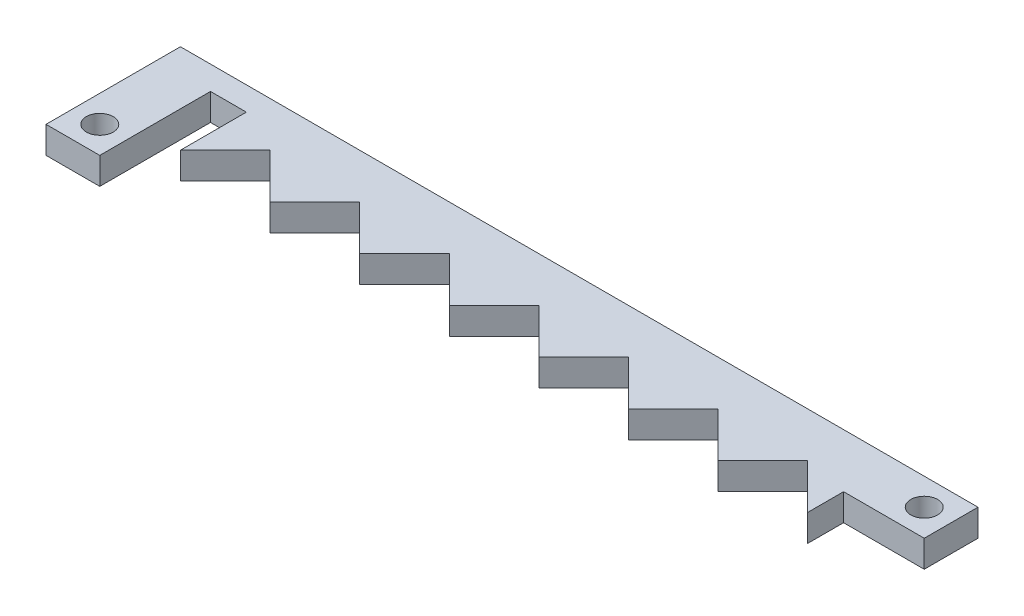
ISO-10303-21;
HEADER;
FILE_DESCRIPTION(('STEP AP214'),'2;1');
FILE_NAME('part.step','',(''),(''),'','','');
FILE_SCHEMA(('AUTOMOTIVE_DESIGN { 1 0 10303 214 1 1 1 1 }'));
ENDSEC;
DATA;
#1=APPLICATION_CONTEXT('core data for automotive mechanical design processes');
#2=APPLICATION_PROTOCOL_DEFINITION('international standard','automotive_design',2000,#1);
#3=PRODUCT_CONTEXT('',#1,'mechanical');
#4=PRODUCT('Part','Part','',(#3));
#5=PRODUCT_RELATED_PRODUCT_CATEGORY('part','',(#4));
#6=PRODUCT_DEFINITION_FORMATION('','',#4);
#7=PRODUCT_DEFINITION_CONTEXT('part definition',#1,'design');
#8=PRODUCT_DEFINITION('design','',#6,#7);
#9=PRODUCT_DEFINITION_SHAPE('','',#8);
#10=(LENGTH_UNIT() NAMED_UNIT(*) SI_UNIT(.MILLI.,.METRE.));
#11=(NAMED_UNIT(*) PLANE_ANGLE_UNIT() SI_UNIT($,.RADIAN.));
#12=(NAMED_UNIT(*) SI_UNIT($,.STERADIAN.) SOLID_ANGLE_UNIT());
#13=UNCERTAINTY_MEASURE_WITH_UNIT(LENGTH_MEASURE(1.E-05),#10,'distance_accuracy_value','');
#14=(GEOMETRIC_REPRESENTATION_CONTEXT(3) GLOBAL_UNCERTAINTY_ASSIGNED_CONTEXT((#13)) GLOBAL_UNIT_ASSIGNED_CONTEXT((#10,
#11,#12)) REPRESENTATION_CONTEXT('',''));
#15=CARTESIAN_POINT('',(0.,0.,0.));
#16=DIRECTION('',(0.,0.,1.));
#17=DIRECTION('',(1.,0.,0.));
#18=AXIS2_PLACEMENT_3D('',#15,#16,#17);
#19=CARTESIAN_POINT('',(0.,3.,0.));
#20=DIRECTION('',(0.,1.,0.));
#21=DIRECTION('',(0.,0.,1.));
#22=AXIS2_PLACEMENT_3D('',#19,#20,#21);
#23=PLANE('',#22);
#24=CARTESIAN_POINT('',(-7.00000000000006,3.,-36.3411545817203));
#25=DIRECTION('',(0.,1.,0.));
#26=DIRECTION('',(0.,0.,1.));
#27=AXIS2_PLACEMENT_3D('',#24,#25,#26);
#28=CIRCLE('',#27,1.5);
#29=CARTESIAN_POINT('',(-7.00000000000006,3.,-34.8411545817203));
#30=VERTEX_POINT('',#29);
#31=EDGE_CURVE('E224',#30,#30,#28,.T.);
#32=ORIENTED_EDGE('',*,*,#31,.F.);
#33=EDGE_LOOP('',(#32));
#34=FACE_BOUND('',#33,.T.);
#35=DIRECTION('',(-1.,0.,0.));
#36=VECTOR('',#35,1.);
#37=CARTESIAN_POINT('',(5.,3.,-48.3411545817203));
#38=LINE('',#37,#36);
#39=CARTESIAN_POINT('',(78.9999999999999,3.,-48.3411545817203));
#40=VERTEX_POINT('',#39);
#41=CARTESIAN_POINT('',(-10.0000000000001,3.,-48.3411545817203));
#42=VERTEX_POINT('',#41);
#43=EDGE_CURVE('E50',#40,#42,#38,.T.);
#44=ORIENTED_EDGE('',*,*,#43,.T.);
#45=DIRECTION('',(0.,0.,1.));
#46=VECTOR('',#45,1.);
#47=CARTESIAN_POINT('',(-10.0000000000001,3.,-48.3411545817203));
#48=LINE('',#47,#46);
#49=CARTESIAN_POINT('',(-10.0000000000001,3.,-33.3411545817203));
#50=VERTEX_POINT('',#49);
#51=EDGE_CURVE('E389',#42,#50,#48,.T.);
#52=ORIENTED_EDGE('',*,*,#51,.T.);
#53=DIRECTION('',(1.,0.,0.));
#54=VECTOR('',#53,1.);
#55=CARTESIAN_POINT('',(-10.0000000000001,3.,-33.3411545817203));
#56=LINE('',#55,#54);
#57=CARTESIAN_POINT('',(-4.00000000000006,3.,-33.3411545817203));
#58=VERTEX_POINT('',#57);
#59=EDGE_CURVE('E326',#50,#58,#56,.T.);
#60=ORIENTED_EDGE('',*,*,#59,.T.);
#61=DIRECTION('',(0.,0.,-1.));
#62=VECTOR('',#61,1.);
#63=CARTESIAN_POINT('',(-4.00000000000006,3.,-33.3411545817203));
#64=LINE('',#63,#62);
#65=CARTESIAN_POINT('',(-4.00000000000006,3.,-45.6968116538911));
#66=VERTEX_POINT('',#65);
#67=EDGE_CURVE('E344',#58,#66,#64,.T.);
#68=ORIENTED_EDGE('',*,*,#67,.T.);
#69=DIRECTION('',(1.,0.,0.));
#70=VECTOR('',#69,1.);
#71=CARTESIAN_POINT('',(-4.00000000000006,3.,-45.6968116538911));
#72=LINE('',#71,#70);
#73=CARTESIAN_POINT('',(0.,3.,-45.6968116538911));
#74=VERTEX_POINT('',#73);
#75=EDGE_CURVE('E341',#66,#74,#72,.T.);
#76=ORIENTED_EDGE('',*,*,#75,.T.);
#77=DIRECTION('',(0.,0.,1.));
#78=VECTOR('',#77,1.);
#79=CARTESIAN_POINT('',(0.,3.,-42.3411545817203));
#80=LINE('',#79,#78);
#81=CARTESIAN_POINT('',(0.,3.,-38.3411545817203));
#82=VERTEX_POINT('',#81);
#83=EDGE_CURVE('E343',#74,#82,#80,.T.);
#84=ORIENTED_EDGE('',*,*,#83,.T.);
#85=DIRECTION('',(0.707106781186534,0.,-0.707106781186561));
#86=VECTOR('',#85,1.);
#87=CARTESIAN_POINT('',(0.,3.,-38.3411545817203));
#88=LINE('',#87,#86);
#89=CARTESIAN_POINT('',(4.99999999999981,3.,-43.3411545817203));
#90=VERTEX_POINT('',#89);
#91=EDGE_CURVE('E346',#82,#90,#88,.T.);
#92=ORIENTED_EDGE('',*,*,#91,.T.);
#93=DIRECTION('',(0.707106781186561,0.,0.707106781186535));
#94=VECTOR('',#93,1.);
#95=CARTESIAN_POINT('',(4.99999999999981,3.,-43.3411545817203));
#96=LINE('',#95,#94);
#97=CARTESIAN_POINT('',(10.,3.,-38.3411545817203));
#98=VERTEX_POINT('',#97);
#99=EDGE_CURVE('E352',#90,#98,#96,.T.);
#100=ORIENTED_EDGE('',*,*,#99,.T.);
#101=DIRECTION('',(0.707106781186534,0.,-0.707106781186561));
#102=VECTOR('',#101,1.);
#103=CARTESIAN_POINT('',(10.,3.,-38.3411545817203));
#104=LINE('',#103,#102);
#105=CARTESIAN_POINT('',(14.9999999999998,3.,-43.3411545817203));
#106=VERTEX_POINT('',#105);
#107=EDGE_CURVE('E354',#98,#106,#104,.T.);
#108=ORIENTED_EDGE('',*,*,#107,.T.);
#109=DIRECTION('',(0.707106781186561,0.,0.707106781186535));
#110=VECTOR('',#109,1.);
#111=CARTESIAN_POINT('',(14.9999999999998,3.,-43.3411545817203));
#112=LINE('',#111,#110);
#113=CARTESIAN_POINT('',(20.,3.,-38.3411545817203));
#114=VERTEX_POINT('',#113);
#115=EDGE_CURVE('E356',#106,#114,#112,.T.);
#116=ORIENTED_EDGE('',*,*,#115,.T.);
#117=DIRECTION('',(0.707106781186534,0.,-0.707106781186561));
#118=VECTOR('',#117,1.);
#119=CARTESIAN_POINT('',(20.,3.,-38.3411545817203));
#120=LINE('',#119,#118);
#121=CARTESIAN_POINT('',(24.9999999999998,3.,-43.3411545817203));
#122=VERTEX_POINT('',#121);
#123=EDGE_CURVE('E358',#114,#122,#120,.T.);
#124=ORIENTED_EDGE('',*,*,#123,.T.);
#125=DIRECTION('',(0.707106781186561,0.,0.707106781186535));
#126=VECTOR('',#125,1.);
#127=CARTESIAN_POINT('',(24.9999999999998,3.,-43.3411545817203));
#128=LINE('',#127,#126);
#129=CARTESIAN_POINT('',(30.,3.,-38.3411545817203));
#130=VERTEX_POINT('',#129);
#131=EDGE_CURVE('E360',#122,#130,#128,.T.);
#132=ORIENTED_EDGE('',*,*,#131,.T.);
#133=DIRECTION('',(0.707106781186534,0.,-0.707106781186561));
#134=VECTOR('',#133,1.);
#135=CARTESIAN_POINT('',(30.,3.,-38.3411545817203));
#136=LINE('',#135,#134);
#137=CARTESIAN_POINT('',(34.9999999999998,3.,-43.3411545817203));
#138=VERTEX_POINT('',#137);
#139=EDGE_CURVE('E362',#130,#138,#136,.T.);
#140=ORIENTED_EDGE('',*,*,#139,.T.);
#141=DIRECTION('',(0.70710678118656,0.,0.707106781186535));
#142=VECTOR('',#141,1.);
#143=CARTESIAN_POINT('',(34.9999999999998,3.,-43.3411545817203));
#144=LINE('',#143,#142);
#145=CARTESIAN_POINT('',(40.,3.,-38.3411545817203));
#146=VERTEX_POINT('',#145);
#147=EDGE_CURVE('E364',#138,#146,#144,.T.);
#148=ORIENTED_EDGE('',*,*,#147,.T.);
#149=DIRECTION('',(0.707106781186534,0.,-0.707106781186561));
#150=VECTOR('',#149,1.);
#151=CARTESIAN_POINT('',(40.,3.,-38.3411545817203));
#152=LINE('',#151,#150);
#153=CARTESIAN_POINT('',(44.9999999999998,3.,-43.3411545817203));
#154=VERTEX_POINT('',#153);
#155=EDGE_CURVE('E366',#146,#154,#152,.T.);
#156=ORIENTED_EDGE('',*,*,#155,.T.);
#157=DIRECTION('',(0.70710678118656,0.,0.707106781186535));
#158=VECTOR('',#157,1.);
#159=CARTESIAN_POINT('',(44.9999999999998,3.,-43.3411545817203));
#160=LINE('',#159,#158);
#161=CARTESIAN_POINT('',(50.,3.,-38.3411545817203));
#162=VERTEX_POINT('',#161);
#163=EDGE_CURVE('E368',#154,#162,#160,.T.);
#164=ORIENTED_EDGE('',*,*,#163,.T.);
#165=DIRECTION('',(0.707106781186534,0.,-0.707106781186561));
#166=VECTOR('',#165,1.);
#167=CARTESIAN_POINT('',(50.,3.,-38.3411545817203));
#168=LINE('',#167,#166);
#169=CARTESIAN_POINT('',(54.9999999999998,3.,-43.3411545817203));
#170=VERTEX_POINT('',#169);
#171=EDGE_CURVE('E370',#162,#170,#168,.T.);
#172=ORIENTED_EDGE('',*,*,#171,.T.);
#173=DIRECTION('',(0.70710678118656,0.,0.707106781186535));
#174=VECTOR('',#173,1.);
#175=CARTESIAN_POINT('',(54.9999999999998,3.,-43.3411545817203));
#176=LINE('',#175,#174);
#177=CARTESIAN_POINT('',(60.,3.,-38.3411545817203));
#178=VERTEX_POINT('',#177);
#179=EDGE_CURVE('E372',#170,#178,#176,.T.);
#180=ORIENTED_EDGE('',*,*,#179,.T.);
#181=DIRECTION('',(0.707106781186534,0.,-0.707106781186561));
#182=VECTOR('',#181,1.);
#183=CARTESIAN_POINT('',(60.,3.,-38.3411545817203));
#184=LINE('',#183,#182);
#185=CARTESIAN_POINT('',(64.9999999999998,3.,-43.3411545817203));
#186=VERTEX_POINT('',#185);
#187=EDGE_CURVE('E374',#178,#186,#184,.T.);
#188=ORIENTED_EDGE('',*,*,#187,.T.);
#189=DIRECTION('',(0.70710678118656,0.,0.707106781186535));
#190=VECTOR('',#189,1.);
#191=CARTESIAN_POINT('',(64.9999999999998,3.,-43.3411545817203));
#192=LINE('',#191,#190);
#193=CARTESIAN_POINT('',(70.,3.,-38.3411545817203));
#194=VERTEX_POINT('',#193);
#195=EDGE_CURVE('E201',#186,#194,#192,.T.);
#196=ORIENTED_EDGE('',*,*,#195,.T.);
#197=DIRECTION('',(0.,0.,-1.));
#198=VECTOR('',#197,1.);
#199=CARTESIAN_POINT('',(69.9999999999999,3.,-42.3411545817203));
#200=LINE('',#199,#198);
#201=CARTESIAN_POINT('',(69.9999999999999,3.,-42.3411545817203));
#202=VERTEX_POINT('',#201);
#203=EDGE_CURVE('E195',#194,#202,#200,.T.);
#204=ORIENTED_EDGE('',*,*,#203,.T.);
#205=DIRECTION('',(1.,0.,0.));
#206=VECTOR('',#205,1.);
#207=CARTESIAN_POINT('',(78.9999999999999,3.,-42.3411545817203));
#208=LINE('',#207,#206);
#209=CARTESIAN_POINT('',(78.9999999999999,3.,-42.3411545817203));
#210=VERTEX_POINT('',#209);
#211=EDGE_CURVE('E199',#202,#210,#208,.T.);
#212=ORIENTED_EDGE('',*,*,#211,.T.);
#213=DIRECTION('',(0.,0.,-1.));
#214=VECTOR('',#213,1.);
#215=CARTESIAN_POINT('',(78.9999999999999,3.,-48.3411545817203));
#216=LINE('',#215,#214);
#217=EDGE_CURVE('E215',#210,#40,#216,.T.);
#218=ORIENTED_EDGE('',*,*,#217,.T.);
#219=EDGE_LOOP('',(#44,#52,#60,#68,#76,#84,#92,#100,#108,#116,#124,#132,#140,#148,#156,#164,
#172,#180,#188,#196,#204,#212,#218));
#220=FACE_BOUND('',#219,.T.);
#221=CARTESIAN_POINT('',(75.9999999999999,3.,-45.3411545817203));
#222=DIRECTION('',(0.,1.,0.));
#223=DIRECTION('',(0.,0.,1.));
#224=AXIS2_PLACEMENT_3D('',#221,#222,#223);
#225=CIRCLE('',#224,1.5);
#226=CARTESIAN_POINT('',(75.9999999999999,3.,-43.8411545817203));
#227=VERTEX_POINT('',#226);
#228=EDGE_CURVE('E396',#227,#227,#225,.T.);
#229=ORIENTED_EDGE('',*,*,#228,.F.);
#230=EDGE_LOOP('',(#229));
#231=FACE_BOUND('',#230,.T.);
#232=ADVANCED_FACE('F33',(#34,#220,#231),#23,.T.);
#233=CARTESIAN_POINT('',(0.,0.,0.));
#234=DIRECTION('',(0.,1.,0.));
#235=DIRECTION('',(0.,0.,1.));
#236=AXIS2_PLACEMENT_3D('',#233,#234,#235);
#237=PLANE('',#236);
#238=DIRECTION('',(0.,0.,1.));
#239=VECTOR('',#238,1.);
#240=CARTESIAN_POINT('',(-10.0000000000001,0.,-48.3411545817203));
#241=LINE('',#240,#239);
#242=CARTESIAN_POINT('',(-10.0000000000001,0.,-48.3411545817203));
#243=VERTEX_POINT('',#242);
#244=CARTESIAN_POINT('',(-10.0000000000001,0.,-33.3411545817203));
#245=VERTEX_POINT('',#244);
#246=EDGE_CURVE('E221',#243,#245,#241,.T.);
#247=ORIENTED_EDGE('',*,*,#246,.F.);
#248=DIRECTION('',(-1.,0.,0.));
#249=VECTOR('',#248,1.);
#250=CARTESIAN_POINT('',(5.,0.,-48.3411545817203));
#251=LINE('',#250,#249);
#252=CARTESIAN_POINT('',(78.9999999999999,0.,-48.3411545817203));
#253=VERTEX_POINT('',#252);
#254=EDGE_CURVE('E132',#253,#243,#251,.T.);
#255=ORIENTED_EDGE('',*,*,#254,.F.);
#256=DIRECTION('',(0.,0.,-1.));
#257=VECTOR('',#256,1.);
#258=CARTESIAN_POINT('',(78.9999999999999,0.,-48.3411545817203));
#259=LINE('',#258,#257);
#260=CARTESIAN_POINT('',(78.9999999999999,0.,-42.3411545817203));
#261=VERTEX_POINT('',#260);
#262=EDGE_CURVE('E263',#261,#253,#259,.T.);
#263=ORIENTED_EDGE('',*,*,#262,.F.);
#264=DIRECTION('',(1.,0.,0.));
#265=VECTOR('',#264,1.);
#266=CARTESIAN_POINT('',(78.9999999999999,0.,-42.3411545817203));
#267=LINE('',#266,#265);
#268=CARTESIAN_POINT('',(69.9999999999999,0.,-42.3411545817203));
#269=VERTEX_POINT('',#268);
#270=EDGE_CURVE('E125',#269,#261,#267,.T.);
#271=ORIENTED_EDGE('',*,*,#270,.F.);
#272=DIRECTION('',(0.,0.,-1.));
#273=VECTOR('',#272,1.);
#274=CARTESIAN_POINT('',(69.9999999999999,0.,-42.3411545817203));
#275=LINE('',#274,#273);
#276=CARTESIAN_POINT('',(70.,0.,-38.3411545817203));
#277=VERTEX_POINT('',#276);
#278=EDGE_CURVE('E209',#277,#269,#275,.T.);
#279=ORIENTED_EDGE('',*,*,#278,.F.);
#280=DIRECTION('',(0.70710678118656,0.,0.707106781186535));
#281=VECTOR('',#280,1.);
#282=CARTESIAN_POINT('',(64.9999999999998,0.,-43.3411545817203));
#283=LINE('',#282,#281);
#284=CARTESIAN_POINT('',(64.9999999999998,0.,-43.3411545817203));
#285=VERTEX_POINT('',#284);
#286=EDGE_CURVE('E259',#285,#277,#283,.T.);
#287=ORIENTED_EDGE('',*,*,#286,.F.);
#288=DIRECTION('',(0.707106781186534,0.,-0.707106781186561));
#289=VECTOR('',#288,1.);
#290=CARTESIAN_POINT('',(60.,0.,-38.3411545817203));
#291=LINE('',#290,#289);
#292=CARTESIAN_POINT('',(60.,0.,-38.3411545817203));
#293=VERTEX_POINT('',#292);
#294=EDGE_CURVE('E257',#293,#285,#291,.T.);
#295=ORIENTED_EDGE('',*,*,#294,.F.);
#296=DIRECTION('',(0.70710678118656,0.,0.707106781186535));
#297=VECTOR('',#296,1.);
#298=CARTESIAN_POINT('',(54.9999999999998,0.,-43.3411545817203));
#299=LINE('',#298,#297);
#300=CARTESIAN_POINT('',(54.9999999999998,0.,-43.3411545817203));
#301=VERTEX_POINT('',#300);
#302=EDGE_CURVE('E255',#301,#293,#299,.T.);
#303=ORIENTED_EDGE('',*,*,#302,.F.);
#304=DIRECTION('',(0.707106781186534,0.,-0.707106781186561));
#305=VECTOR('',#304,1.);
#306=CARTESIAN_POINT('',(50.,0.,-38.3411545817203));
#307=LINE('',#306,#305);
#308=CARTESIAN_POINT('',(50.,0.,-38.3411545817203));
#309=VERTEX_POINT('',#308);
#310=EDGE_CURVE('E253',#309,#301,#307,.T.);
#311=ORIENTED_EDGE('',*,*,#310,.F.);
#312=DIRECTION('',(0.70710678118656,0.,0.707106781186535));
#313=VECTOR('',#312,1.);
#314=CARTESIAN_POINT('',(44.9999999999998,0.,-43.3411545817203));
#315=LINE('',#314,#313);
#316=CARTESIAN_POINT('',(44.9999999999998,0.,-43.3411545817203));
#317=VERTEX_POINT('',#316);
#318=EDGE_CURVE('E251',#317,#309,#315,.T.);
#319=ORIENTED_EDGE('',*,*,#318,.F.);
#320=DIRECTION('',(0.707106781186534,0.,-0.707106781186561));
#321=VECTOR('',#320,1.);
#322=CARTESIAN_POINT('',(40.,0.,-38.3411545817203));
#323=LINE('',#322,#321);
#324=CARTESIAN_POINT('',(40.,0.,-38.3411545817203));
#325=VERTEX_POINT('',#324);
#326=EDGE_CURVE('E249',#325,#317,#323,.T.);
#327=ORIENTED_EDGE('',*,*,#326,.F.);
#328=DIRECTION('',(0.70710678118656,0.,0.707106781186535));
#329=VECTOR('',#328,1.);
#330=CARTESIAN_POINT('',(34.9999999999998,0.,-43.3411545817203));
#331=LINE('',#330,#329);
#332=CARTESIAN_POINT('',(34.9999999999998,0.,-43.3411545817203));
#333=VERTEX_POINT('',#332);
#334=EDGE_CURVE('E247',#333,#325,#331,.T.);
#335=ORIENTED_EDGE('',*,*,#334,.F.);
#336=DIRECTION('',(0.707106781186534,0.,-0.707106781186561));
#337=VECTOR('',#336,1.);
#338=CARTESIAN_POINT('',(30.,0.,-38.3411545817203));
#339=LINE('',#338,#337);
#340=CARTESIAN_POINT('',(30.,0.,-38.3411545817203));
#341=VERTEX_POINT('',#340);
#342=EDGE_CURVE('E245',#341,#333,#339,.T.);
#343=ORIENTED_EDGE('',*,*,#342,.F.);
#344=DIRECTION('',(0.707106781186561,0.,0.707106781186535));
#345=VECTOR('',#344,1.);
#346=CARTESIAN_POINT('',(24.9999999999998,0.,-43.3411545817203));
#347=LINE('',#346,#345);
#348=CARTESIAN_POINT('',(24.9999999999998,0.,-43.3411545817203));
#349=VERTEX_POINT('',#348);
#350=EDGE_CURVE('E243',#349,#341,#347,.T.);
#351=ORIENTED_EDGE('',*,*,#350,.F.);
#352=DIRECTION('',(0.707106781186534,0.,-0.707106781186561));
#353=VECTOR('',#352,1.);
#354=CARTESIAN_POINT('',(20.,0.,-38.3411545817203));
#355=LINE('',#354,#353);
#356=CARTESIAN_POINT('',(20.,0.,-38.3411545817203));
#357=VERTEX_POINT('',#356);
#358=EDGE_CURVE('E241',#357,#349,#355,.T.);
#359=ORIENTED_EDGE('',*,*,#358,.F.);
#360=DIRECTION('',(0.707106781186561,0.,0.707106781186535));
#361=VECTOR('',#360,1.);
#362=CARTESIAN_POINT('',(14.9999999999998,0.,-43.3411545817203));
#363=LINE('',#362,#361);
#364=CARTESIAN_POINT('',(14.9999999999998,0.,-43.3411545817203));
#365=VERTEX_POINT('',#364);
#366=EDGE_CURVE('E239',#365,#357,#363,.T.);
#367=ORIENTED_EDGE('',*,*,#366,.F.);
#368=DIRECTION('',(0.707106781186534,0.,-0.707106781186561));
#369=VECTOR('',#368,1.);
#370=CARTESIAN_POINT('',(10.,0.,-38.3411545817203));
#371=LINE('',#370,#369);
#372=CARTESIAN_POINT('',(10.,0.,-38.3411545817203));
#373=VERTEX_POINT('',#372);
#374=EDGE_CURVE('E237',#373,#365,#371,.T.);
#375=ORIENTED_EDGE('',*,*,#374,.F.);
#376=DIRECTION('',(0.707106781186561,0.,0.707106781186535));
#377=VECTOR('',#376,1.);
#378=CARTESIAN_POINT('',(4.99999999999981,0.,-43.3411545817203));
#379=LINE('',#378,#377);
#380=CARTESIAN_POINT('',(4.99999999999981,0.,-43.3411545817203));
#381=VERTEX_POINT('',#380);
#382=EDGE_CURVE('E235',#381,#373,#379,.T.);
#383=ORIENTED_EDGE('',*,*,#382,.F.);
#384=DIRECTION('',(0.707106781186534,0.,-0.707106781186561));
#385=VECTOR('',#384,1.);
#386=CARTESIAN_POINT('',(0.,0.,-38.3411545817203));
#387=LINE('',#386,#385);
#388=CARTESIAN_POINT('',(0.,0.,-38.3411545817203));
#389=VERTEX_POINT('',#388);
#390=EDGE_CURVE('E233',#389,#381,#387,.T.);
#391=ORIENTED_EDGE('',*,*,#390,.F.);
#392=DIRECTION('',(0.,0.,1.));
#393=VECTOR('',#392,1.);
#394=CARTESIAN_POINT('',(0.,0.,-42.3411545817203));
#395=LINE('',#394,#393);
#396=CARTESIAN_POINT('',(0.,0.,-45.6968116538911));
#397=VERTEX_POINT('',#396);
#398=EDGE_CURVE('E231',#397,#389,#395,.T.);
#399=ORIENTED_EDGE('',*,*,#398,.F.);
#400=DIRECTION('',(1.,0.,0.));
#401=VECTOR('',#400,1.);
#402=CARTESIAN_POINT('',(-4.00000000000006,0.,-45.6968116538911));
#403=LINE('',#402,#401);
#404=CARTESIAN_POINT('',(-4.00000000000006,0.,-45.6968116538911));
#405=VERTEX_POINT('',#404);
#406=EDGE_CURVE('E228',#405,#397,#403,.T.);
#407=ORIENTED_EDGE('',*,*,#406,.F.);
#408=DIRECTION('',(0.,0.,-1.));
#409=VECTOR('',#408,1.);
#410=CARTESIAN_POINT('',(-4.00000000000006,0.,-33.3411545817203));
#411=LINE('',#410,#409);
#412=CARTESIAN_POINT('',(-4.00000000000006,0.,-33.3411545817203));
#413=VERTEX_POINT('',#412);
#414=EDGE_CURVE('E226',#413,#405,#411,.T.);
#415=ORIENTED_EDGE('',*,*,#414,.F.);
#416=DIRECTION('',(1.,0.,0.));
#417=VECTOR('',#416,1.);
#418=CARTESIAN_POINT('',(-10.0000000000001,0.,-33.3411545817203));
#419=LINE('',#418,#417);
#420=EDGE_CURVE('E223',#245,#413,#419,.T.);
#421=ORIENTED_EDGE('',*,*,#420,.F.);
#422=EDGE_LOOP('',(#247,#255,#263,#271,#279,#287,#295,#303,#311,#319,#327,#335,#343,#351,#359,
#367,#375,#383,#391,#399,#407,#415,#421));
#423=FACE_BOUND('',#422,.T.);
#424=CARTESIAN_POINT('',(-7.00000000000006,0.,-36.3411545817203));
#425=DIRECTION('',(0.,1.,0.));
#426=DIRECTION('',(0.,0.,1.));
#427=AXIS2_PLACEMENT_3D('',#424,#425,#426);
#428=CIRCLE('',#427,1.5);
#429=CARTESIAN_POINT('',(-7.00000000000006,0.,-34.8411545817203));
#430=VERTEX_POINT('',#429);
#431=EDGE_CURVE('E393',#430,#430,#428,.T.);
#432=ORIENTED_EDGE('',*,*,#431,.T.);
#433=EDGE_LOOP('',(#432));
#434=FACE_BOUND('',#433,.T.);
#435=CARTESIAN_POINT('',(75.9999999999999,0.,-45.3411545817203));
#436=DIRECTION('',(0.,1.,0.));
#437=DIRECTION('',(0.,0.,1.));
#438=AXIS2_PLACEMENT_3D('',#435,#436,#437);
#439=CIRCLE('',#438,1.5);
#440=CARTESIAN_POINT('',(75.9999999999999,0.,-43.8411545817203));
#441=VERTEX_POINT('',#440);
#442=EDGE_CURVE('E399',#441,#441,#439,.T.);
#443=ORIENTED_EDGE('',*,*,#442,.T.);
#444=EDGE_LOOP('',(#443));
#445=FACE_BOUND('',#444,.T.);
#446=ADVANCED_FACE('F330',(#423,#434,#445),#237,.F.);
#447=CARTESIAN_POINT('',(-10.0000000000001,3.,-48.3411545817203));
#448=DIRECTION('',(1.,0.,0.));
#449=DIRECTION('',(0.,0.,-1.));
#450=AXIS2_PLACEMENT_3D('',#447,#448,#449);
#451=PLANE('',#450);
#452=ORIENTED_EDGE('',*,*,#246,.T.);
#453=DIRECTION('',(0.,-1.,0.));
#454=VECTOR('',#453,1.);
#455=CARTESIAN_POINT('',(-10.0000000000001,3.,-33.3411545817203));
#456=LINE('',#455,#454);
#457=EDGE_CURVE('E42',#50,#245,#456,.T.);
#458=ORIENTED_EDGE('',*,*,#457,.F.);
#459=ORIENTED_EDGE('',*,*,#51,.F.);
#460=DIRECTION('',(0.,-1.,0.));
#461=VECTOR('',#460,1.);
#462=CARTESIAN_POINT('',(-10.0000000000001,3.,-48.3411545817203));
#463=LINE('',#462,#461);
#464=EDGE_CURVE('E11',#42,#243,#463,.T.);
#465=ORIENTED_EDGE('',*,*,#464,.T.);
#466=EDGE_LOOP('',(#452,#458,#459,#465));
#467=FACE_BOUND('',#466,.T.);
#468=ADVANCED_FACE('F35',(#467),#451,.F.);
#469=CARTESIAN_POINT('',(-10.0000000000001,3.,-33.3411545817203));
#470=DIRECTION('',(0.,0.,-1.));
#471=DIRECTION('',(-1.,0.,0.));
#472=AXIS2_PLACEMENT_3D('',#469,#470,#471);
#473=PLANE('',#472);
#474=ORIENTED_EDGE('',*,*,#420,.T.);
#475=DIRECTION('',(0.,-1.,0.));
#476=VECTOR('',#475,1.);
#477=CARTESIAN_POINT('',(-4.00000000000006,3.,-33.3411545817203));
#478=LINE('',#477,#476);
#479=EDGE_CURVE('E317',#58,#413,#478,.T.);
#480=ORIENTED_EDGE('',*,*,#479,.F.);
#481=ORIENTED_EDGE('',*,*,#59,.F.);
#482=ORIENTED_EDGE('',*,*,#457,.T.);
#483=EDGE_LOOP('',(#474,#480,#481,#482));
#484=FACE_BOUND('',#483,.T.);
#485=ADVANCED_FACE('F324',(#484),#473,.F.);
#486=CARTESIAN_POINT('',(-4.00000000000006,3.,-33.3411545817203));
#487=DIRECTION('',(-1.,0.,0.));
#488=DIRECTION('',(0.,0.,1.));
#489=AXIS2_PLACEMENT_3D('',#486,#487,#488);
#490=PLANE('',#489);
#491=ORIENTED_EDGE('',*,*,#414,.T.);
#492=DIRECTION('',(0.,-1.,0.));
#493=VECTOR('',#492,1.);
#494=CARTESIAN_POINT('',(-4.00000000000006,3.,-45.6968116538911));
#495=LINE('',#494,#493);
#496=EDGE_CURVE('E314',#66,#405,#495,.T.);
#497=ORIENTED_EDGE('',*,*,#496,.F.);
#498=ORIENTED_EDGE('',*,*,#67,.F.);
#499=ORIENTED_EDGE('',*,*,#479,.T.);
#500=EDGE_LOOP('',(#491,#497,#498,#499));
#501=FACE_BOUND('',#500,.T.);
#502=ADVANCED_FACE('F335',(#501),#490,.F.);
#503=CARTESIAN_POINT('',(-4.00000000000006,3.,-45.6968116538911));
#504=DIRECTION('',(0.,0.,-1.));
#505=DIRECTION('',(-1.,0.,0.));
#506=AXIS2_PLACEMENT_3D('',#503,#504,#505);
#507=PLANE('',#506);
#508=ORIENTED_EDGE('',*,*,#406,.T.);
#509=DIRECTION('',(0.,-1.,0.));
#510=VECTOR('',#509,1.);
#511=CARTESIAN_POINT('',(0.,3.,-45.6968116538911));
#512=LINE('',#511,#510);
#513=EDGE_CURVE('E311',#74,#397,#512,.T.);
#514=ORIENTED_EDGE('',*,*,#513,.F.);
#515=ORIENTED_EDGE('',*,*,#75,.F.);
#516=ORIENTED_EDGE('',*,*,#496,.T.);
#517=EDGE_LOOP('',(#508,#514,#515,#516));
#518=FACE_BOUND('',#517,.T.);
#519=ADVANCED_FACE('F339',(#518),#507,.F.);
#520=CARTESIAN_POINT('',(0.,3.,-42.3411545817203));
#521=DIRECTION('',(1.,0.,0.));
#522=DIRECTION('',(0.,0.,-1.));
#523=AXIS2_PLACEMENT_3D('',#520,#521,#522);
#524=PLANE('',#523);
#525=ORIENTED_EDGE('',*,*,#398,.T.);
#526=DIRECTION('',(0.,-1.,0.));
#527=VECTOR('',#526,1.);
#528=CARTESIAN_POINT('',(0.,3.,-38.3411545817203));
#529=LINE('',#528,#527);
#530=EDGE_CURVE('E308',#82,#389,#529,.T.);
#531=ORIENTED_EDGE('',*,*,#530,.F.);
#532=ORIENTED_EDGE('',*,*,#83,.F.);
#533=ORIENTED_EDGE('',*,*,#513,.T.);
#534=EDGE_LOOP('',(#525,#531,#532,#533));
#535=FACE_BOUND('',#534,.T.);
#536=ADVANCED_FACE('F478',(#535),#524,.F.);
#537=CARTESIAN_POINT('',(0.,3.,-38.3411545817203));
#538=DIRECTION('',(-0.707106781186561,0.,-0.707106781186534));
#539=DIRECTION('',(-0.707106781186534,0.,0.707106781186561));
#540=AXIS2_PLACEMENT_3D('',#537,#538,#539);
#541=PLANE('',#540);
#542=ORIENTED_EDGE('',*,*,#390,.T.);
#543=DIRECTION('',(0.,-1.,0.));
#544=VECTOR('',#543,1.);
#545=CARTESIAN_POINT('',(4.99999999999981,3.,-43.3411545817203));
#546=LINE('',#545,#544);
#547=EDGE_CURVE('E305',#90,#381,#546,.T.);
#548=ORIENTED_EDGE('',*,*,#547,.F.);
#549=ORIENTED_EDGE('',*,*,#91,.F.);
#550=ORIENTED_EDGE('',*,*,#530,.T.);
#551=EDGE_LOOP('',(#542,#548,#549,#550));
#552=FACE_BOUND('',#551,.T.);
#553=ADVANCED_FACE('F474',(#552),#541,.F.);
#554=CARTESIAN_POINT('',(4.99999999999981,3.,-43.3411545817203));
#555=DIRECTION('',(0.707106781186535,0.,-0.70710678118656));
#556=DIRECTION('',(-0.70710678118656,0.,-0.707106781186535));
#557=AXIS2_PLACEMENT_3D('',#554,#555,#556);
#558=PLANE('',#557);
#559=ORIENTED_EDGE('',*,*,#382,.T.);
#560=DIRECTION('',(0.,-1.,0.));
#561=VECTOR('',#560,1.);
#562=CARTESIAN_POINT('',(10.,3.,-38.3411545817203));
#563=LINE('',#562,#561);
#564=EDGE_CURVE('E302',#98,#373,#563,.T.);
#565=ORIENTED_EDGE('',*,*,#564,.F.);
#566=ORIENTED_EDGE('',*,*,#99,.F.);
#567=ORIENTED_EDGE('',*,*,#547,.T.);
#568=EDGE_LOOP('',(#559,#565,#566,#567));
#569=FACE_BOUND('',#568,.T.);
#570=ADVANCED_FACE('F470',(#569),#558,.F.);
#571=CARTESIAN_POINT('',(10.,3.,-38.3411545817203));
#572=DIRECTION('',(-0.707106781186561,0.,-0.707106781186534));
#573=DIRECTION('',(-0.707106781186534,0.,0.707106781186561));
#574=AXIS2_PLACEMENT_3D('',#571,#572,#573);
#575=PLANE('',#574);
#576=ORIENTED_EDGE('',*,*,#374,.T.);
#577=DIRECTION('',(0.,-1.,0.));
#578=VECTOR('',#577,1.);
#579=CARTESIAN_POINT('',(14.9999999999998,3.,-43.3411545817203));
#580=LINE('',#579,#578);
#581=EDGE_CURVE('E299',#106,#365,#580,.T.);
#582=ORIENTED_EDGE('',*,*,#581,.F.);
#583=ORIENTED_EDGE('',*,*,#107,.F.);
#584=ORIENTED_EDGE('',*,*,#564,.T.);
#585=EDGE_LOOP('',(#576,#582,#583,#584));
#586=FACE_BOUND('',#585,.T.);
#587=ADVANCED_FACE('F466',(#586),#575,.F.);
#588=CARTESIAN_POINT('',(14.9999999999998,3.,-43.3411545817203));
#589=DIRECTION('',(0.707106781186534,0.,-0.70710678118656));
#590=DIRECTION('',(-0.707106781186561,0.,-0.707106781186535));
#591=AXIS2_PLACEMENT_3D('',#588,#589,#590);
#592=PLANE('',#591);
#593=ORIENTED_EDGE('',*,*,#366,.T.);
#594=DIRECTION('',(0.,-1.,0.));
#595=VECTOR('',#594,1.);
#596=CARTESIAN_POINT('',(20.,3.,-38.3411545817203));
#597=LINE('',#596,#595);
#598=EDGE_CURVE('E296',#114,#357,#597,.T.);
#599=ORIENTED_EDGE('',*,*,#598,.F.);
#600=ORIENTED_EDGE('',*,*,#115,.F.);
#601=ORIENTED_EDGE('',*,*,#581,.T.);
#602=EDGE_LOOP('',(#593,#599,#600,#601));
#603=FACE_BOUND('',#602,.T.);
#604=ADVANCED_FACE('F462',(#603),#592,.F.);
#605=CARTESIAN_POINT('',(20.,3.,-38.3411545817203));
#606=DIRECTION('',(-0.707106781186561,0.,-0.707106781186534));
#607=DIRECTION('',(-0.707106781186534,0.,0.707106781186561));
#608=AXIS2_PLACEMENT_3D('',#605,#606,#607);
#609=PLANE('',#608);
#610=ORIENTED_EDGE('',*,*,#358,.T.);
#611=DIRECTION('',(0.,-1.,0.));
#612=VECTOR('',#611,1.);
#613=CARTESIAN_POINT('',(24.9999999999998,3.,-43.3411545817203));
#614=LINE('',#613,#612);
#615=EDGE_CURVE('E293',#122,#349,#614,.T.);
#616=ORIENTED_EDGE('',*,*,#615,.F.);
#617=ORIENTED_EDGE('',*,*,#123,.F.);
#618=ORIENTED_EDGE('',*,*,#598,.T.);
#619=EDGE_LOOP('',(#610,#616,#617,#618));
#620=FACE_BOUND('',#619,.T.);
#621=ADVANCED_FACE('F458',(#620),#609,.F.);
#622=CARTESIAN_POINT('',(24.9999999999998,3.,-43.3411545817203));
#623=DIRECTION('',(0.707106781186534,0.,-0.70710678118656));
#624=DIRECTION('',(-0.707106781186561,0.,-0.707106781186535));
#625=AXIS2_PLACEMENT_3D('',#622,#623,#624);
#626=PLANE('',#625);
#627=ORIENTED_EDGE('',*,*,#350,.T.);
#628=DIRECTION('',(0.,-1.,0.));
#629=VECTOR('',#628,1.);
#630=CARTESIAN_POINT('',(30.,3.,-38.3411545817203));
#631=LINE('',#630,#629);
#632=EDGE_CURVE('E290',#130,#341,#631,.T.);
#633=ORIENTED_EDGE('',*,*,#632,.F.);
#634=ORIENTED_EDGE('',*,*,#131,.F.);
#635=ORIENTED_EDGE('',*,*,#615,.T.);
#636=EDGE_LOOP('',(#627,#633,#634,#635));
#637=FACE_BOUND('',#636,.T.);
#638=ADVANCED_FACE('F454',(#637),#626,.F.);
#639=CARTESIAN_POINT('',(30.,3.,-38.3411545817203));
#640=DIRECTION('',(-0.707106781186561,0.,-0.707106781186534));
#641=DIRECTION('',(-0.707106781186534,0.,0.707106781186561));
#642=AXIS2_PLACEMENT_3D('',#639,#640,#641);
#643=PLANE('',#642);
#644=ORIENTED_EDGE('',*,*,#342,.T.);
#645=DIRECTION('',(0.,-1.,0.));
#646=VECTOR('',#645,1.);
#647=CARTESIAN_POINT('',(34.9999999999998,3.,-43.3411545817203));
#648=LINE('',#647,#646);
#649=EDGE_CURVE('E287',#138,#333,#648,.T.);
#650=ORIENTED_EDGE('',*,*,#649,.F.);
#651=ORIENTED_EDGE('',*,*,#139,.F.);
#652=ORIENTED_EDGE('',*,*,#632,.T.);
#653=EDGE_LOOP('',(#644,#650,#651,#652));
#654=FACE_BOUND('',#653,.T.);
#655=ADVANCED_FACE('F450',(#654),#643,.F.);
#656=CARTESIAN_POINT('',(34.9999999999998,3.,-43.3411545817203));
#657=DIRECTION('',(0.707106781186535,0.,-0.70710678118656));
#658=DIRECTION('',(-0.70710678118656,0.,-0.707106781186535));
#659=AXIS2_PLACEMENT_3D('',#656,#657,#658);
#660=PLANE('',#659);
#661=ORIENTED_EDGE('',*,*,#334,.T.);
#662=DIRECTION('',(0.,-1.,0.));
#663=VECTOR('',#662,1.);
#664=CARTESIAN_POINT('',(40.,3.,-38.3411545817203));
#665=LINE('',#664,#663);
#666=EDGE_CURVE('E284',#146,#325,#665,.T.);
#667=ORIENTED_EDGE('',*,*,#666,.F.);
#668=ORIENTED_EDGE('',*,*,#147,.F.);
#669=ORIENTED_EDGE('',*,*,#649,.T.);
#670=EDGE_LOOP('',(#661,#667,#668,#669));
#671=FACE_BOUND('',#670,.T.);
#672=ADVANCED_FACE('F446',(#671),#660,.F.);
#673=CARTESIAN_POINT('',(40.,3.,-38.3411545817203));
#674=DIRECTION('',(-0.707106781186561,0.,-0.707106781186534));
#675=DIRECTION('',(-0.707106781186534,0.,0.707106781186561));
#676=AXIS2_PLACEMENT_3D('',#673,#674,#675);
#677=PLANE('',#676);
#678=ORIENTED_EDGE('',*,*,#326,.T.);
#679=DIRECTION('',(0.,-1.,0.));
#680=VECTOR('',#679,1.);
#681=CARTESIAN_POINT('',(44.9999999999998,3.,-43.3411545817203));
#682=LINE('',#681,#680);
#683=EDGE_CURVE('E281',#154,#317,#682,.T.);
#684=ORIENTED_EDGE('',*,*,#683,.F.);
#685=ORIENTED_EDGE('',*,*,#155,.F.);
#686=ORIENTED_EDGE('',*,*,#666,.T.);
#687=EDGE_LOOP('',(#678,#684,#685,#686));
#688=FACE_BOUND('',#687,.T.);
#689=ADVANCED_FACE('F442',(#688),#677,.F.);
#690=CARTESIAN_POINT('',(44.9999999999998,3.,-43.3411545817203));
#691=DIRECTION('',(0.707106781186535,0.,-0.70710678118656));
#692=DIRECTION('',(-0.70710678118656,0.,-0.707106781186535));
#693=AXIS2_PLACEMENT_3D('',#690,#691,#692);
#694=PLANE('',#693);
#695=ORIENTED_EDGE('',*,*,#318,.T.);
#696=DIRECTION('',(0.,-1.,0.));
#697=VECTOR('',#696,1.);
#698=CARTESIAN_POINT('',(50.,3.,-38.3411545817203));
#699=LINE('',#698,#697);
#700=EDGE_CURVE('E278',#162,#309,#699,.T.);
#701=ORIENTED_EDGE('',*,*,#700,.F.);
#702=ORIENTED_EDGE('',*,*,#163,.F.);
#703=ORIENTED_EDGE('',*,*,#683,.T.);
#704=EDGE_LOOP('',(#695,#701,#702,#703));
#705=FACE_BOUND('',#704,.T.);
#706=ADVANCED_FACE('F438',(#705),#694,.F.);
#707=CARTESIAN_POINT('',(50.,3.,-38.3411545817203));
#708=DIRECTION('',(-0.707106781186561,0.,-0.707106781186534));
#709=DIRECTION('',(-0.707106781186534,0.,0.707106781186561));
#710=AXIS2_PLACEMENT_3D('',#707,#708,#709);
#711=PLANE('',#710);
#712=ORIENTED_EDGE('',*,*,#310,.T.);
#713=DIRECTION('',(0.,-1.,0.));
#714=VECTOR('',#713,1.);
#715=CARTESIAN_POINT('',(54.9999999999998,3.,-43.3411545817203));
#716=LINE('',#715,#714);
#717=EDGE_CURVE('E275',#170,#301,#716,.T.);
#718=ORIENTED_EDGE('',*,*,#717,.F.);
#719=ORIENTED_EDGE('',*,*,#171,.F.);
#720=ORIENTED_EDGE('',*,*,#700,.T.);
#721=EDGE_LOOP('',(#712,#718,#719,#720));
#722=FACE_BOUND('',#721,.T.);
#723=ADVANCED_FACE('F434',(#722),#711,.F.);
#724=CARTESIAN_POINT('',(54.9999999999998,3.,-43.3411545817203));
#725=DIRECTION('',(0.707106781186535,0.,-0.70710678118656));
#726=DIRECTION('',(-0.70710678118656,0.,-0.707106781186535));
#727=AXIS2_PLACEMENT_3D('',#724,#725,#726);
#728=PLANE('',#727);
#729=ORIENTED_EDGE('',*,*,#302,.T.);
#730=DIRECTION('',(0.,-1.,0.));
#731=VECTOR('',#730,1.);
#732=CARTESIAN_POINT('',(60.,3.,-38.3411545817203));
#733=LINE('',#732,#731);
#734=EDGE_CURVE('E272',#178,#293,#733,.T.);
#735=ORIENTED_EDGE('',*,*,#734,.F.);
#736=ORIENTED_EDGE('',*,*,#179,.F.);
#737=ORIENTED_EDGE('',*,*,#717,.T.);
#738=EDGE_LOOP('',(#729,#735,#736,#737));
#739=FACE_BOUND('',#738,.T.);
#740=ADVANCED_FACE('F431',(#739),#728,.F.);
#741=CARTESIAN_POINT('',(60.,3.,-38.3411545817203));
#742=DIRECTION('',(-0.707106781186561,0.,-0.707106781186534));
#743=DIRECTION('',(-0.707106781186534,0.,0.707106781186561));
#744=AXIS2_PLACEMENT_3D('',#741,#742,#743);
#745=PLANE('',#744);
#746=ORIENTED_EDGE('',*,*,#294,.T.);
#747=DIRECTION('',(0.,-1.,0.));
#748=VECTOR('',#747,1.);
#749=CARTESIAN_POINT('',(64.9999999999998,3.,-43.3411545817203));
#750=LINE('',#749,#748);
#751=EDGE_CURVE('E269',#186,#285,#750,.T.);
#752=ORIENTED_EDGE('',*,*,#751,.F.);
#753=ORIENTED_EDGE('',*,*,#187,.F.);
#754=ORIENTED_EDGE('',*,*,#734,.T.);
#755=EDGE_LOOP('',(#746,#752,#753,#754));
#756=FACE_BOUND('',#755,.T.);
#757=ADVANCED_FACE('F380',(#756),#745,.F.);
#758=CARTESIAN_POINT('',(64.9999999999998,3.,-43.3411545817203));
#759=DIRECTION('',(0.707106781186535,0.,-0.70710678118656));
#760=DIRECTION('',(-0.70710678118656,0.,-0.707106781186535));
#761=AXIS2_PLACEMENT_3D('',#758,#759,#760);
#762=PLANE('',#761);
#763=ORIENTED_EDGE('',*,*,#286,.T.);
#764=DIRECTION('',(0.,-1.,0.));
#765=VECTOR('',#764,1.);
#766=CARTESIAN_POINT('',(70.,3.,-38.3411545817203));
#767=LINE('',#766,#765);
#768=EDGE_CURVE('E210',#194,#277,#767,.T.);
#769=ORIENTED_EDGE('',*,*,#768,.F.);
#770=ORIENTED_EDGE('',*,*,#195,.F.);
#771=ORIENTED_EDGE('',*,*,#751,.T.);
#772=EDGE_LOOP('',(#763,#769,#770,#771));
#773=FACE_BOUND('',#772,.T.);
#774=ADVANCED_FACE('F384',(#773),#762,.F.);
#775=CARTESIAN_POINT('',(69.9999999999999,3.,-42.3411545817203));
#776=DIRECTION('',(-1.,0.,0.));
#777=DIRECTION('',(0.,0.,1.));
#778=AXIS2_PLACEMENT_3D('',#775,#776,#777);
#779=PLANE('',#778);
#780=ORIENTED_EDGE('',*,*,#278,.T.);
#781=DIRECTION('',(0.,-1.,0.));
#782=VECTOR('',#781,1.);
#783=CARTESIAN_POINT('',(69.9999999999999,3.,-42.3411545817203));
#784=LINE('',#783,#782);
#785=EDGE_CURVE('E206',#202,#269,#784,.T.);
#786=ORIENTED_EDGE('',*,*,#785,.F.);
#787=ORIENTED_EDGE('',*,*,#203,.F.);
#788=ORIENTED_EDGE('',*,*,#768,.T.);
#789=EDGE_LOOP('',(#780,#786,#787,#788));
#790=FACE_BOUND('',#789,.T.);
#791=ADVANCED_FACE('F207',(#790),#779,.F.);
#792=CARTESIAN_POINT('',(78.9999999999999,3.,-42.3411545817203));
#793=DIRECTION('',(0.,0.,-1.));
#794=DIRECTION('',(-1.,0.,0.));
#795=AXIS2_PLACEMENT_3D('',#792,#793,#794);
#796=PLANE('',#795);
#797=ORIENTED_EDGE('',*,*,#270,.T.);
#798=DIRECTION('',(0.,-1.,0.));
#799=VECTOR('',#798,1.);
#800=CARTESIAN_POINT('',(78.9999999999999,3.,-42.3411545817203));
#801=LINE('',#800,#799);
#802=EDGE_CURVE('E211',#210,#261,#801,.T.);
#803=ORIENTED_EDGE('',*,*,#802,.F.);
#804=ORIENTED_EDGE('',*,*,#211,.F.);
#805=ORIENTED_EDGE('',*,*,#785,.T.);
#806=EDGE_LOOP('',(#797,#803,#804,#805));
#807=FACE_BOUND('',#806,.T.);
#808=ADVANCED_FACE('F213',(#807),#796,.F.);
#809=CARTESIAN_POINT('',(78.9999999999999,3.,-48.3411545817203));
#810=DIRECTION('',(-1.,0.,0.));
#811=DIRECTION('',(0.,0.,1.));
#812=AXIS2_PLACEMENT_3D('',#809,#810,#811);
#813=PLANE('',#812);
#814=ORIENTED_EDGE('',*,*,#262,.T.);
#815=DIRECTION('',(0.,-1.,0.));
#816=VECTOR('',#815,1.);
#817=CARTESIAN_POINT('',(78.9999999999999,3.,-48.3411545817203));
#818=LINE('',#817,#816);
#819=EDGE_CURVE('E217',#40,#253,#818,.T.);
#820=ORIENTED_EDGE('',*,*,#819,.F.);
#821=ORIENTED_EDGE('',*,*,#217,.F.);
#822=ORIENTED_EDGE('',*,*,#802,.T.);
#823=EDGE_LOOP('',(#814,#820,#821,#822));
#824=FACE_BOUND('',#823,.T.);
#825=ADVANCED_FACE('F387',(#824),#813,.F.);
#826=CARTESIAN_POINT('',(5.,3.,-48.3411545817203));
#827=DIRECTION('',(0.,0.,1.));
#828=DIRECTION('',(1.,0.,0.));
#829=AXIS2_PLACEMENT_3D('',#826,#827,#828);
#830=PLANE('',#829);
#831=ORIENTED_EDGE('',*,*,#254,.T.);
#832=ORIENTED_EDGE('',*,*,#464,.F.);
#833=ORIENTED_EDGE('',*,*,#43,.F.);
#834=ORIENTED_EDGE('',*,*,#819,.T.);
#835=EDGE_LOOP('',(#831,#832,#833,#834));
#836=FACE_BOUND('',#835,.T.);
#837=ADVANCED_FACE('F388',(#836),#830,.F.);
#838=CARTESIAN_POINT('',(-7.00000000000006,3.,-36.3411545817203));
#839=DIRECTION('',(0.,-1.,0.));
#840=DIRECTION('',(0.,0.,-1.));
#841=AXIS2_PLACEMENT_3D('',#838,#839,#840);
#842=CYLINDRICAL_SURFACE('',#841,1.5);
#843=ORIENTED_EDGE('',*,*,#31,.T.);
#844=EDGE_LOOP('',(#843));
#845=FACE_BOUND('',#844,.T.);
#846=ORIENTED_EDGE('',*,*,#431,.F.);
#847=EDGE_LOOP('',(#846));
#848=FACE_BOUND('',#847,.T.);
#849=ADVANCED_FACE('F416',(#845,#848),#842,.F.);
#850=CARTESIAN_POINT('',(75.9999999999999,3.,-45.3411545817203));
#851=DIRECTION('',(0.,-1.,0.));
#852=DIRECTION('',(0.,0.,-1.));
#853=AXIS2_PLACEMENT_3D('',#850,#851,#852);
#854=CYLINDRICAL_SURFACE('',#853,1.5);
#855=ORIENTED_EDGE('',*,*,#228,.T.);
#856=EDGE_LOOP('',(#855));
#857=FACE_BOUND('',#856,.T.);
#858=ORIENTED_EDGE('',*,*,#442,.F.);
#859=EDGE_LOOP('',(#858));
#860=FACE_BOUND('',#859,.T.);
#861=ADVANCED_FACE('F405',(#857,#860),#854,.F.);
#862=CLOSED_SHELL('',(#232,#446,#468,#485,#502,#519,#536,#553,#570,#587,#604,#621,#638,#655,
#672,#689,#706,#723,#740,#757,#774,#791,#808,#825,#837,#849,#861));
#863=MANIFOLD_SOLID_BREP('B2',#862);
#864=ADVANCED_BREP_SHAPE_REPRESENTATION('',(#18,#863),#14);
#865=SHAPE_DEFINITION_REPRESENTATION(#9,#864);
ENDSEC;
END-ISO-10303-21;
